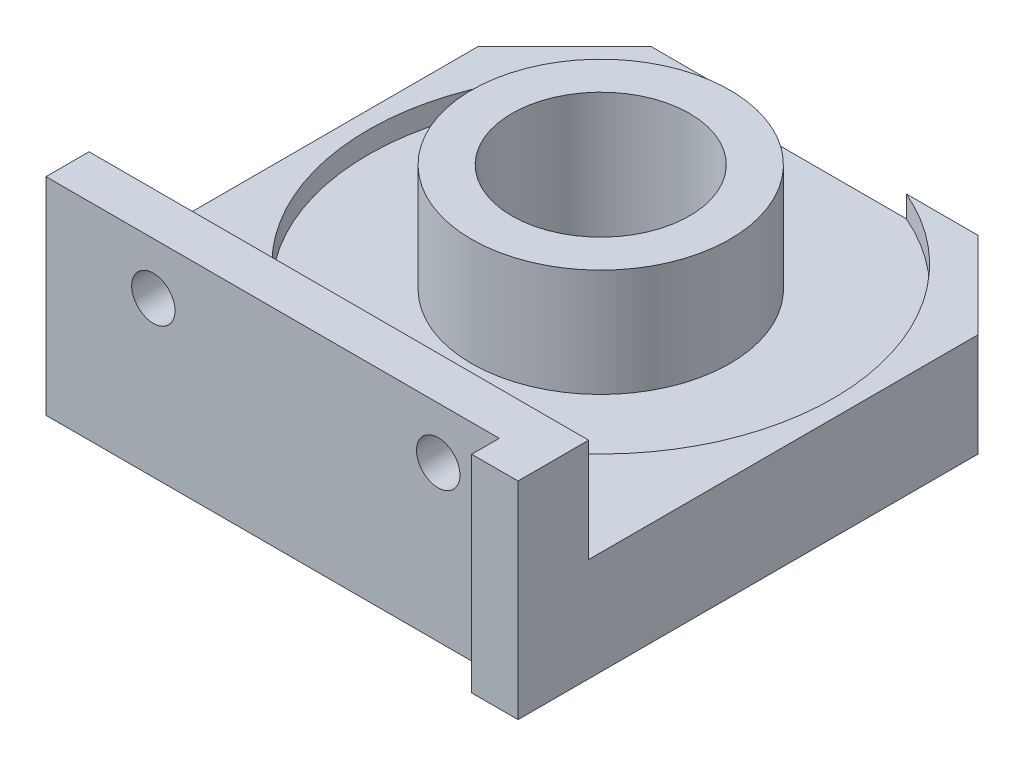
from build123d import *

# Parameters (mm, degrees)
SKETCH1_W                 = 36.83
SKETCH1_H                 = 38.227
BOSS_EXTRUDE1_DEPTH       = 7.62
SKETCH2_W                 = 36.83
SKETCH2_H                 = 3.175
BOSS_EXTRUDE2_DEPTH       = 7.62
SKETCH3_W                 = 3.415
SKETCH3_H                 = 15.24
BOSS_EXTRUDE3_DEPTH       = 2.032
SKETCH4_R                 = 9.525
BOSS_EXTRUDE4_DEPTH       = 6.35
F_9_16_18_TAPPED_HOLE1_D  = 13.09624
M3_CLEARANCE_HOLE1_D      = 3.2
M3_CLEARANCE_HOLE1_DEPTH  = 3.175
CHAMFER1_SIZE             = 6.35
M3X0_5_TAPPED_HOLE1_D     = 2.5
M3X0_5_TAPPED_HOLE1_DEPTH = 7.5
CUT_EXTRUDE1_START        = -1.5875
SKETCH11_R                = 17.145
SKETCH11_R_2              = 9.525
CUT_EXTRUDE1_DEPTH        = 1.5875


with BuildPart() as part:
    # Sketch1 → Boss-Extrude1 (new body)
    with BuildSketch(Plane(origin=(0, 0, 0), x_dir=(1, 0, 0), z_dir=(0, 1, 0))):
        with Locations((-18.415, 19.1135)):
            Rectangle(SKETCH1_W, SKETCH1_H)
    extrude(amount=-BOSS_EXTRUDE1_DEPTH)

    # Sketch2 → Boss-Extrude2 (add)
    with BuildSketch(Plane(origin=(0, 0, 0), x_dir=(1, 0, 0), z_dir=(0, 1, 0))):
        with Locations((-18.415, 1.5875)):
            Rectangle(SKETCH2_W, SKETCH2_H)
    extrude(amount=BOSS_EXTRUDE2_DEPTH)

    # Sketch3 → Boss-Extrude3 (add)
    with BuildSketch(Plane.XY):
        with Locations((-1.7075, 0)):
            Rectangle(SKETCH3_W, SKETCH3_H)
    extrude(amount=BOSS_EXTRUDE3_DEPTH)

    # Sketch4 → Boss-Extrude4 (add)
    with BuildSketch(Plane(origin=(0, 0, 0), x_dir=(1, 0, 0), z_dir=(0, 1, 0))):
        with Locations(Location((-18.415, 22.48, 0), (0, 0, 270))):
            Circle(SKETCH4_R)
    extrude(amount=BOSS_EXTRUDE4_DEPTH)

    # 9_16-18 Tapped Hole1 (through all)
    with Locations(Plane(origin=(0, 6.35, 0), x_dir=(1, 0, 0), z_dir=(0, 1, 0))):
        with Locations((-18.415, 22.48)):
            Hole(F_9_16_18_TAPPED_HOLE1_D / 2)

    # M3 Clearance Hole1
    with Locations(Plane(origin=(0, 0, -3.175), x_dir=(-1, 0, 0), z_dir=(0, 0, -1))):
        with Locations((28.915, 3.81), (7.915, 3.81)):
            Hole(M3_CLEARANCE_HOLE1_D / 2, depth=M3_CLEARANCE_HOLE1_DEPTH)

    # Chamfer1
    chamfer1_edges = [part.edges().sort_by_distance(p)[0] for p in [
        (0, -3.81, -38.227),
        (-36.83, -3.81, -38.227),
    ]]
    chamfer(chamfer1_edges, length=CHAMFER1_SIZE)

    # M3x0.5 Tapped Hole1
    with Locations(Plane.ZY.offset(36.83)):
        with Locations((-7.4295, -3.81), (-26.4795, -3.81)):
            Hole(M3X0_5_TAPPED_HOLE1_D / 2, depth=M3X0_5_TAPPED_HOLE1_DEPTH)

    # Sketch11 → Cut-Extrude1 (cut)
    with BuildSketch(Plane(origin=(0, 0, 0), x_dir=(1, 0, 0), z_dir=(0, 1, 0)).offset(CUT_EXTRUDE1_START)):
        with Locations((-18.415, 22.48)):
            Circle(SKETCH11_R)
        with Locations(Location((-18.415, 22.48, 0), (0, 0, 270))):
            Circle(SKETCH11_R_2, mode=Mode.SUBTRACT)
    extrude(amount=CUT_EXTRUDE1_DEPTH, mode=Mode.SUBTRACT)


solid = part.part
